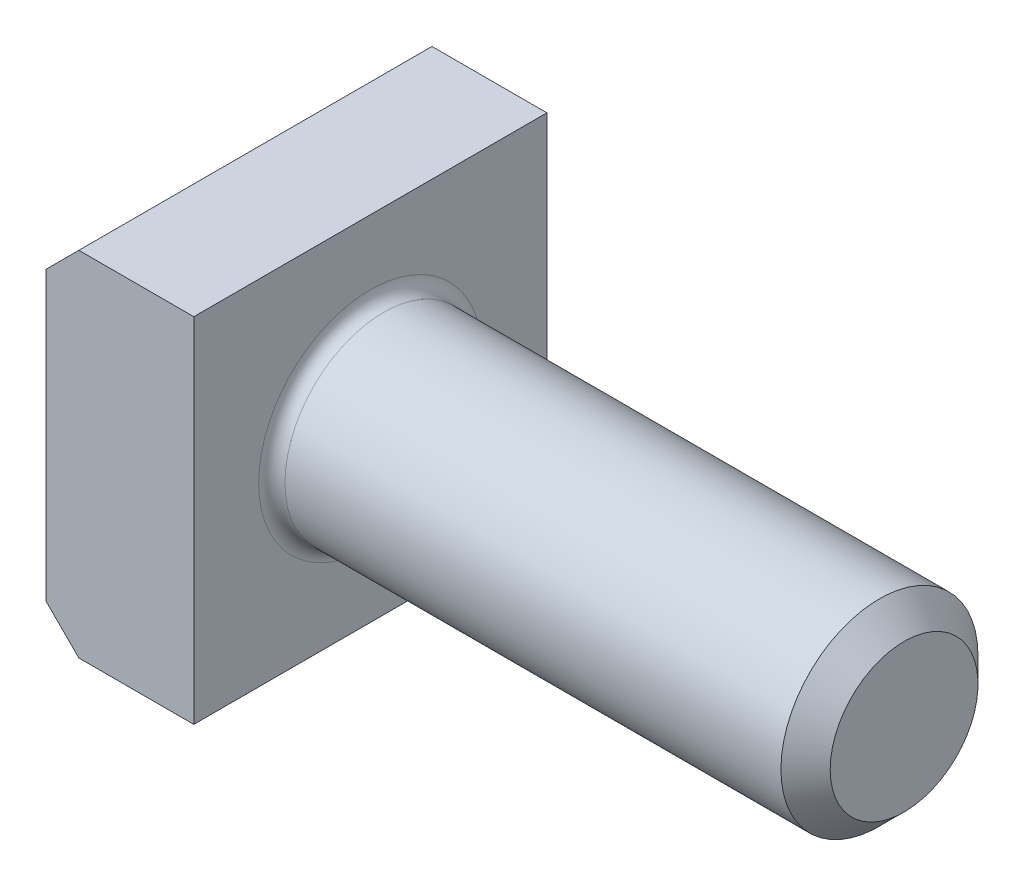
ISO-10303-21;
HEADER;
FILE_DESCRIPTION(('STEP AP214'),'2;1');
FILE_NAME('part.step','',(''),(''),'','','');
FILE_SCHEMA(('AUTOMOTIVE_DESIGN { 1 0 10303 214 1 1 1 1 }'));
ENDSEC;
DATA;
#1=APPLICATION_CONTEXT('core data for automotive mechanical design processes');
#2=APPLICATION_PROTOCOL_DEFINITION('international standard','automotive_design',2000,#1);
#3=PRODUCT_CONTEXT('',#1,'mechanical');
#4=PRODUCT('Part','Part','',(#3));
#5=PRODUCT_RELATED_PRODUCT_CATEGORY('part','',(#4));
#6=PRODUCT_DEFINITION_FORMATION('','',#4);
#7=PRODUCT_DEFINITION_CONTEXT('part definition',#1,'design');
#8=PRODUCT_DEFINITION('design','',#6,#7);
#9=PRODUCT_DEFINITION_SHAPE('','',#8);
#10=(LENGTH_UNIT() NAMED_UNIT(*) SI_UNIT(.MILLI.,.METRE.));
#11=(NAMED_UNIT(*) PLANE_ANGLE_UNIT() SI_UNIT($,.RADIAN.));
#12=(NAMED_UNIT(*) SI_UNIT($,.STERADIAN.) SOLID_ANGLE_UNIT());
#13=UNCERTAINTY_MEASURE_WITH_UNIT(LENGTH_MEASURE(1.E-05),#10,'distance_accuracy_value','');
#14=(GEOMETRIC_REPRESENTATION_CONTEXT(3) GLOBAL_UNCERTAINTY_ASSIGNED_CONTEXT((#13)) GLOBAL_UNIT_ASSIGNED_CONTEXT((#10,
#11,#12)) REPRESENTATION_CONTEXT('',''));
#15=CARTESIAN_POINT('',(0.,0.,0.));
#16=DIRECTION('',(0.,0.,1.));
#17=DIRECTION('',(1.,0.,0.));
#18=AXIS2_PLACEMENT_3D('',#15,#16,#17);
#19=CARTESIAN_POINT('',(65.,0.,0.));
#20=DIRECTION('',(1.,0.,0.));
#21=DIRECTION('',(0.,0.,-1.));
#22=AXIS2_PLACEMENT_3D('',#19,#20,#21);
#23=CYLINDRICAL_SURFACE('',#22,12.);
#24=CARTESIAN_POINT('',(1.6,0.,0.));
#25=DIRECTION('',(-1.,0.,0.));
#26=DIRECTION('',(0.,0.,1.));
#27=AXIS2_PLACEMENT_3D('',#24,#25,#26);
#28=CIRCLE('',#27,12.);
#29=CARTESIAN_POINT('',(1.6,0.,12.));
#30=VERTEX_POINT('',#29);
#31=EDGE_CURVE('E50',#30,#30,#28,.F.);
#32=ORIENTED_EDGE('',*,*,#31,.T.);
#33=EDGE_LOOP('',(#32));
#34=FACE_BOUND('',#33,.T.);
#35=CARTESIAN_POINT('',(62.,0.,0.));
#36=DIRECTION('',(-1.,0.,0.));
#37=DIRECTION('',(0.,0.,1.));
#38=AXIS2_PLACEMENT_3D('',#35,#36,#37);
#39=CIRCLE('',#38,12.);
#40=CARTESIAN_POINT('',(62.,0.,12.));
#41=VERTEX_POINT('',#40);
#42=EDGE_CURVE('E131',#41,#41,#39,.T.);
#43=ORIENTED_EDGE('',*,*,#42,.T.);
#44=EDGE_LOOP('',(#43));
#45=FACE_BOUND('',#44,.T.);
#46=ADVANCED_FACE('F41',(#34,#45),#23,.T.);
#47=CARTESIAN_POINT('',(0.,21.5,21.5));
#48=DIRECTION('',(-1.,0.,0.));
#49=DIRECTION('',(0.,0.,1.));
#50=AXIS2_PLACEMENT_3D('',#47,#48,#49);
#51=PLANE('',#50);
#52=CARTESIAN_POINT('',(0.,0.,0.));
#53=DIRECTION('',(-1.,0.,0.));
#54=DIRECTION('',(0.,0.,1.));
#55=AXIS2_PLACEMENT_3D('',#52,#53,#54);
#56=CIRCLE('',#55,13.6);
#57=CARTESIAN_POINT('',(0.,0.,13.6));
#58=VERTEX_POINT('',#57);
#59=EDGE_CURVE('E12',#58,#58,#56,.T.);
#60=ORIENTED_EDGE('',*,*,#59,.T.);
#61=EDGE_LOOP('',(#60));
#62=FACE_BOUND('',#61,.T.);
#63=DIRECTION('',(0.,1.,0.));
#64=VECTOR('',#63,1.);
#65=CARTESIAN_POINT('',(0.,21.5,-21.5));
#66=LINE('',#65,#64);
#67=CARTESIAN_POINT('',(0.,-21.5,-21.5));
#68=VERTEX_POINT('',#67);
#69=CARTESIAN_POINT('',(0.,21.5,-21.5));
#70=VERTEX_POINT('',#69);
#71=EDGE_CURVE('E127',#68,#70,#66,.T.);
#72=ORIENTED_EDGE('',*,*,#71,.T.);
#73=DIRECTION('',(0.,0.,-1.));
#74=VECTOR('',#73,1.);
#75=CARTESIAN_POINT('',(0.,21.5,21.5));
#76=LINE('',#75,#74);
#77=CARTESIAN_POINT('',(0.,21.5,21.5));
#78=VERTEX_POINT('',#77);
#79=EDGE_CURVE('E145',#78,#70,#76,.T.);
#80=ORIENTED_EDGE('',*,*,#79,.F.);
#81=DIRECTION('',(0.,1.,0.));
#82=VECTOR('',#81,1.);
#83=CARTESIAN_POINT('',(0.,21.5,21.5));
#84=LINE('',#83,#82);
#85=CARTESIAN_POINT('',(0.,-21.5,21.5));
#86=VERTEX_POINT('',#85);
#87=EDGE_CURVE('E138',#86,#78,#84,.T.);
#88=ORIENTED_EDGE('',*,*,#87,.F.);
#89=DIRECTION('',(0.,0.,-1.));
#90=VECTOR('',#89,1.);
#91=CARTESIAN_POINT('',(0.,-21.5,21.5));
#92=LINE('',#91,#90);
#93=EDGE_CURVE('E123',#86,#68,#92,.T.);
#94=ORIENTED_EDGE('',*,*,#93,.T.);
#95=EDGE_LOOP('',(#72,#80,#88,#94));
#96=FACE_BOUND('',#95,.T.);
#97=ADVANCED_FACE('F163',(#62,#96),#51,.F.);
#98=CARTESIAN_POINT('',(-14.,21.5,21.5));
#99=DIRECTION('',(0.,-1.,0.));
#100=DIRECTION('',(0.,0.,-1.));
#101=AXIS2_PLACEMENT_3D('',#98,#99,#100);
#102=PLANE('',#101);
#103=DIRECTION('',(-1.,0.,0.));
#104=VECTOR('',#103,1.);
#105=CARTESIAN_POINT('',(-14.,21.5,-21.5));
#106=LINE('',#105,#104);
#107=CARTESIAN_POINT('',(-14.,21.5,-21.5));
#108=VERTEX_POINT('',#107);
#109=EDGE_CURVE('E130',#70,#108,#106,.T.);
#110=ORIENTED_EDGE('',*,*,#109,.T.);
#111=DIRECTION('',(0.,0.,-1.));
#112=VECTOR('',#111,1.);
#113=CARTESIAN_POINT('',(-14.,21.5,21.5));
#114=LINE('',#113,#112);
#115=CARTESIAN_POINT('',(-14.,21.5,21.5));
#116=VERTEX_POINT('',#115);
#117=EDGE_CURVE('E142',#116,#108,#114,.T.);
#118=ORIENTED_EDGE('',*,*,#117,.F.);
#119=DIRECTION('',(-1.,0.,0.));
#120=VECTOR('',#119,1.);
#121=CARTESIAN_POINT('',(-14.,21.5,21.5));
#122=LINE('',#121,#120);
#123=EDGE_CURVE('E96',#78,#116,#122,.T.);
#124=ORIENTED_EDGE('',*,*,#123,.F.);
#125=ORIENTED_EDGE('',*,*,#79,.T.);
#126=EDGE_LOOP('',(#110,#118,#124,#125));
#127=FACE_BOUND('',#126,.T.);
#128=ADVANCED_FACE('F166',(#127),#102,.F.);
#129=CARTESIAN_POINT('',(-18.,17.5,21.5));
#130=DIRECTION('',(0.707106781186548,-0.707106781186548,0.));
#131=DIRECTION('',(0.707106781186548,0.707106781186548,0.));
#132=AXIS2_PLACEMENT_3D('',#129,#130,#131);
#133=PLANE('',#132);
#134=DIRECTION('',(-0.707106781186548,-0.707106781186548,0.));
#135=VECTOR('',#134,1.);
#136=CARTESIAN_POINT('',(-18.,17.5,-21.5));
#137=LINE('',#136,#135);
#138=CARTESIAN_POINT('',(-18.,17.5,-21.5));
#139=VERTEX_POINT('',#138);
#140=EDGE_CURVE('E133',#108,#139,#137,.T.);
#141=ORIENTED_EDGE('',*,*,#140,.T.);
#142=DIRECTION('',(0.,0.,-1.));
#143=VECTOR('',#142,1.);
#144=CARTESIAN_POINT('',(-18.,17.5,21.5));
#145=LINE('',#144,#143);
#146=CARTESIAN_POINT('',(-18.,17.5,21.5));
#147=VERTEX_POINT('',#146);
#148=EDGE_CURVE('E118',#147,#139,#145,.T.);
#149=ORIENTED_EDGE('',*,*,#148,.F.);
#150=DIRECTION('',(-0.707106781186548,-0.707106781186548,0.));
#151=VECTOR('',#150,1.);
#152=CARTESIAN_POINT('',(-18.,17.5,21.5));
#153=LINE('',#152,#151);
#154=EDGE_CURVE('E109',#116,#147,#153,.T.);
#155=ORIENTED_EDGE('',*,*,#154,.F.);
#156=ORIENTED_EDGE('',*,*,#117,.T.);
#157=EDGE_LOOP('',(#141,#149,#155,#156));
#158=FACE_BOUND('',#157,.T.);
#159=ADVANCED_FACE('F172',(#158),#133,.F.);
#160=CARTESIAN_POINT('',(-18.,17.5,21.5));
#161=DIRECTION('',(1.,0.,0.));
#162=DIRECTION('',(0.,0.,-1.));
#163=AXIS2_PLACEMENT_3D('',#160,#161,#162);
#164=PLANE('',#163);
#165=DIRECTION('',(0.,-1.,0.));
#166=VECTOR('',#165,1.);
#167=CARTESIAN_POINT('',(-18.,17.5,-21.5));
#168=LINE('',#167,#166);
#169=CARTESIAN_POINT('',(-18.,-17.5,-21.5));
#170=VERTEX_POINT('',#169);
#171=EDGE_CURVE('E117',#139,#170,#168,.T.);
#172=ORIENTED_EDGE('',*,*,#171,.T.);
#173=DIRECTION('',(0.,0.,-1.));
#174=VECTOR('',#173,1.);
#175=CARTESIAN_POINT('',(-18.,-17.5,21.5));
#176=LINE('',#175,#174);
#177=CARTESIAN_POINT('',(-18.,-17.5,21.5));
#178=VERTEX_POINT('',#177);
#179=EDGE_CURVE('E114',#178,#170,#176,.T.);
#180=ORIENTED_EDGE('',*,*,#179,.F.);
#181=DIRECTION('',(0.,-1.,0.));
#182=VECTOR('',#181,1.);
#183=CARTESIAN_POINT('',(-18.,17.5,21.5));
#184=LINE('',#183,#182);
#185=EDGE_CURVE('E103',#147,#178,#184,.T.);
#186=ORIENTED_EDGE('',*,*,#185,.F.);
#187=ORIENTED_EDGE('',*,*,#148,.T.);
#188=EDGE_LOOP('',(#172,#180,#186,#187));
#189=FACE_BOUND('',#188,.T.);
#190=ADVANCED_FACE('F115',(#189),#164,.F.);
#191=CARTESIAN_POINT('',(-18.,-17.5,21.5));
#192=DIRECTION('',(0.707106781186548,0.707106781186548,0.));
#193=DIRECTION('',(-0.707106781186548,0.707106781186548,0.));
#194=AXIS2_PLACEMENT_3D('',#191,#192,#193);
#195=PLANE('',#194);
#196=DIRECTION('',(0.707106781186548,-0.707106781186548,0.));
#197=VECTOR('',#196,1.);
#198=CARTESIAN_POINT('',(-18.,-17.5,-21.5));
#199=LINE('',#198,#197);
#200=CARTESIAN_POINT('',(-14.,-21.5,-21.5));
#201=VERTEX_POINT('',#200);
#202=EDGE_CURVE('E81',#170,#201,#199,.T.);
#203=ORIENTED_EDGE('',*,*,#202,.T.);
#204=DIRECTION('',(0.,0.,-1.));
#205=VECTOR('',#204,1.);
#206=CARTESIAN_POINT('',(-14.,-21.5,21.5));
#207=LINE('',#206,#205);
#208=CARTESIAN_POINT('',(-14.,-21.5,21.5));
#209=VERTEX_POINT('',#208);
#210=EDGE_CURVE('E119',#209,#201,#207,.T.);
#211=ORIENTED_EDGE('',*,*,#210,.F.);
#212=DIRECTION('',(0.707106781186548,-0.707106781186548,0.));
#213=VECTOR('',#212,1.);
#214=CARTESIAN_POINT('',(-18.,-17.5,21.5));
#215=LINE('',#214,#213);
#216=EDGE_CURVE('E107',#178,#209,#215,.T.);
#217=ORIENTED_EDGE('',*,*,#216,.F.);
#218=ORIENTED_EDGE('',*,*,#179,.T.);
#219=EDGE_LOOP('',(#203,#211,#217,#218));
#220=FACE_BOUND('',#219,.T.);
#221=ADVANCED_FACE('F121',(#220),#195,.F.);
#222=CARTESIAN_POINT('',(-14.,-21.5,21.5));
#223=DIRECTION('',(0.,1.,0.));
#224=DIRECTION('',(0.,0.,1.));
#225=AXIS2_PLACEMENT_3D('',#222,#223,#224);
#226=PLANE('',#225);
#227=DIRECTION('',(1.,0.,0.));
#228=VECTOR('',#227,1.);
#229=CARTESIAN_POINT('',(-14.,-21.5,-21.5));
#230=LINE('',#229,#228);
#231=EDGE_CURVE('E87',#201,#68,#230,.T.);
#232=ORIENTED_EDGE('',*,*,#231,.T.);
#233=ORIENTED_EDGE('',*,*,#93,.F.);
#234=DIRECTION('',(1.,0.,0.));
#235=VECTOR('',#234,1.);
#236=CARTESIAN_POINT('',(-14.,-21.5,21.5));
#237=LINE('',#236,#235);
#238=EDGE_CURVE('E58',#209,#86,#237,.T.);
#239=ORIENTED_EDGE('',*,*,#238,.F.);
#240=ORIENTED_EDGE('',*,*,#210,.T.);
#241=EDGE_LOOP('',(#232,#233,#239,#240));
#242=FACE_BOUND('',#241,.T.);
#243=ADVANCED_FACE('F180',(#242),#226,.F.);
#244=CARTESIAN_POINT('',(0.,-21.5,21.5));
#245=DIRECTION('',(0.,0.,1.));
#246=DIRECTION('',(1.,0.,0.));
#247=AXIS2_PLACEMENT_3D('',#244,#245,#246);
#248=PLANE('',#247);
#249=ORIENTED_EDGE('',*,*,#87,.T.);
#250=ORIENTED_EDGE('',*,*,#123,.T.);
#251=ORIENTED_EDGE('',*,*,#154,.T.);
#252=ORIENTED_EDGE('',*,*,#185,.T.);
#253=ORIENTED_EDGE('',*,*,#216,.T.);
#254=ORIENTED_EDGE('',*,*,#238,.T.);
#255=EDGE_LOOP('',(#249,#250,#251,#252,#253,#254));
#256=FACE_BOUND('',#255,.T.);
#257=ADVANCED_FACE('F105',(#256),#248,.T.);
#258=CARTESIAN_POINT('',(0.,-21.5,-21.5));
#259=DIRECTION('',(0.,0.,1.));
#260=DIRECTION('',(1.,0.,0.));
#261=AXIS2_PLACEMENT_3D('',#258,#259,#260);
#262=PLANE('',#261);
#263=ORIENTED_EDGE('',*,*,#71,.F.);
#264=ORIENTED_EDGE('',*,*,#231,.F.);
#265=ORIENTED_EDGE('',*,*,#202,.F.);
#266=ORIENTED_EDGE('',*,*,#171,.F.);
#267=ORIENTED_EDGE('',*,*,#140,.F.);
#268=ORIENTED_EDGE('',*,*,#109,.F.);
#269=EDGE_LOOP('',(#263,#264,#265,#266,#267,#268));
#270=FACE_BOUND('',#269,.T.);
#271=ADVANCED_FACE('F183',(#270),#262,.F.);
#272=CARTESIAN_POINT('',(62.,0.,0.));
#273=DIRECTION('',(-1.,0.,0.));
#274=DIRECTION('',(0.,0.,1.));
#275=AXIS2_PLACEMENT_3D('',#272,#273,#274);
#276=CONICAL_SURFACE('',#275,12.,0.785398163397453);
#277=CARTESIAN_POINT('',(65.,0.,0.));
#278=DIRECTION('',(-1.,0.,0.));
#279=DIRECTION('',(0.,0.,1.));
#280=AXIS2_PLACEMENT_3D('',#277,#278,#279);
#281=CIRCLE('',#280,8.99999999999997);
#282=CARTESIAN_POINT('',(65.,0.,8.99999999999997));
#283=VERTEX_POINT('',#282);
#284=EDGE_CURVE('E196',#283,#283,#281,.T.);
#285=ORIENTED_EDGE('',*,*,#284,.T.);
#286=EDGE_LOOP('',(#285));
#287=FACE_BOUND('',#286,.T.);
#288=ORIENTED_EDGE('',*,*,#42,.F.);
#289=EDGE_LOOP('',(#288));
#290=FACE_BOUND('',#289,.T.);
#291=ADVANCED_FACE('F158',(#287,#290),#276,.T.);
#292=CARTESIAN_POINT('',(65.,12.,0.));
#293=DIRECTION('',(1.,0.,0.));
#294=DIRECTION('',(0.,0.,-1.));
#295=AXIS2_PLACEMENT_3D('',#292,#293,#294);
#296=PLANE('',#295);
#297=ORIENTED_EDGE('',*,*,#284,.F.);
#298=EDGE_LOOP('',(#297));
#299=FACE_BOUND('',#298,.T.);
#300=ADVANCED_FACE('F152',(#299),#296,.T.);
#301=CARTESIAN_POINT('',(1.6,0.,0.));
#302=DIRECTION('',(-1.,0.,0.));
#303=DIRECTION('',(0.,0.,1.));
#304=AXIS2_PLACEMENT_3D('',#301,#302,#303);
#305=TOROIDAL_SURFACE('',#304,13.6,1.6);
#306=ORIENTED_EDGE('',*,*,#59,.F.);
#307=EDGE_LOOP('',(#306));
#308=FACE_BOUND('',#307,.T.);
#309=ORIENTED_EDGE('',*,*,#31,.F.);
#310=EDGE_LOOP('',(#309));
#311=FACE_BOUND('',#310,.T.);
#312=ADVANCED_FACE('F43',(#308,#311),#305,.F.);
#313=CLOSED_SHELL('',(#46,#97,#128,#159,#190,#221,#243,#257,#271,#291,#300,#312));
#314=MANIFOLD_SOLID_BREP('B2',#313);
#315=ADVANCED_BREP_SHAPE_REPRESENTATION('',(#18,#314),#14);
#316=SHAPE_DEFINITION_REPRESENTATION(#9,#315);
ENDSEC;
END-ISO-10303-21;
